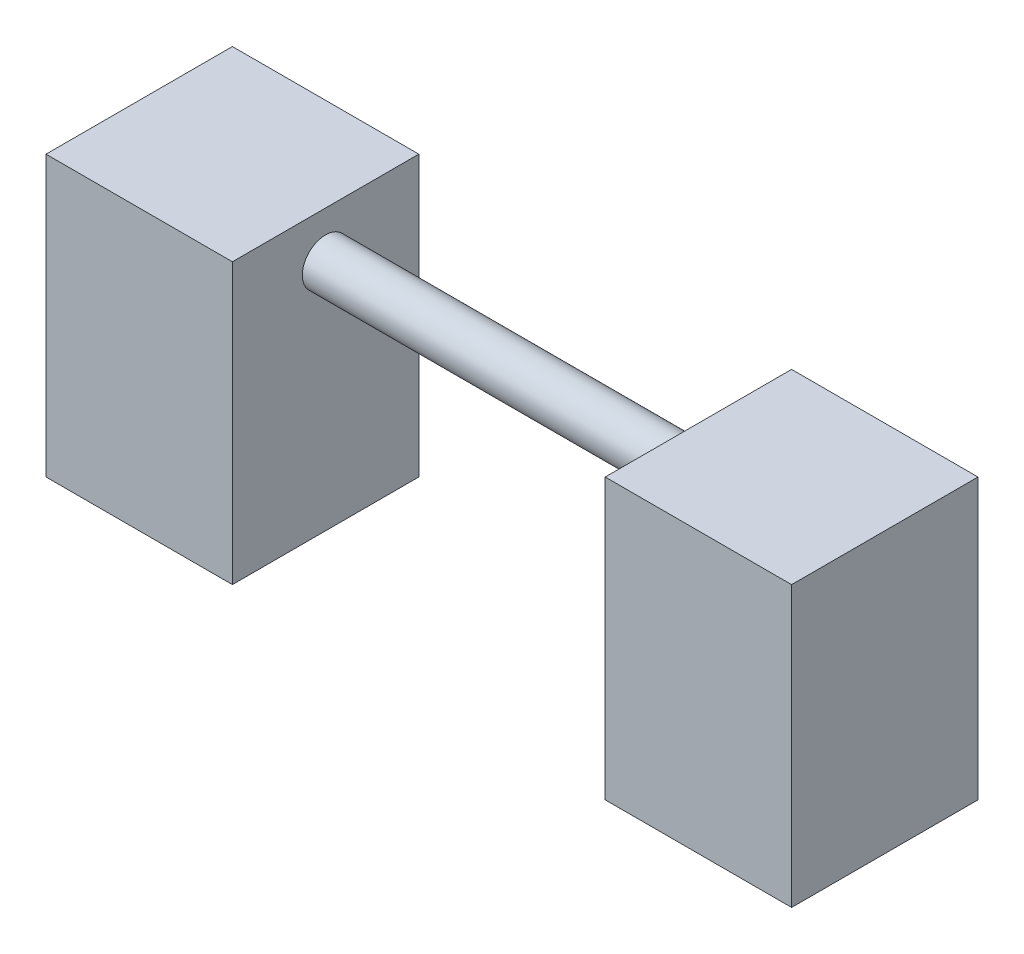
ISO-10303-21;
HEADER;
FILE_DESCRIPTION(('STEP AP214'),'2;1');
FILE_NAME('part.step','',(''),(''),'','','');
FILE_SCHEMA(('AUTOMOTIVE_DESIGN { 1 0 10303 214 1 1 1 1 }'));
ENDSEC;
DATA;
#1=APPLICATION_CONTEXT('core data for automotive mechanical design processes');
#2=APPLICATION_PROTOCOL_DEFINITION('international standard','automotive_design',2000,#1);
#3=PRODUCT_CONTEXT('',#1,'mechanical');
#4=PRODUCT('Part','Part','',(#3));
#5=PRODUCT_RELATED_PRODUCT_CATEGORY('part','',(#4));
#6=PRODUCT_DEFINITION_FORMATION('','',#4);
#7=PRODUCT_DEFINITION_CONTEXT('part definition',#1,'design');
#8=PRODUCT_DEFINITION('design','',#6,#7);
#9=PRODUCT_DEFINITION_SHAPE('','',#8);
#10=(LENGTH_UNIT() NAMED_UNIT(*) SI_UNIT(.MILLI.,.METRE.));
#11=(NAMED_UNIT(*) PLANE_ANGLE_UNIT() SI_UNIT($,.RADIAN.));
#12=(NAMED_UNIT(*) SI_UNIT($,.STERADIAN.) SOLID_ANGLE_UNIT());
#13=UNCERTAINTY_MEASURE_WITH_UNIT(LENGTH_MEASURE(1.E-05),#10,'distance_accuracy_value','');
#14=(GEOMETRIC_REPRESENTATION_CONTEXT(3) GLOBAL_UNCERTAINTY_ASSIGNED_CONTEXT((#13)) GLOBAL_UNIT_ASSIGNED_CONTEXT((#10,
#11,#12)) REPRESENTATION_CONTEXT('',''));
#15=CARTESIAN_POINT('',(0.,0.,0.));
#16=DIRECTION('',(0.,0.,1.));
#17=DIRECTION('',(1.,0.,0.));
#18=AXIS2_PLACEMENT_3D('',#15,#16,#17);
#19=CARTESIAN_POINT('',(-80.,60.,20.));
#20=DIRECTION('',(1.,0.,0.));
#21=DIRECTION('',(0.,0.,-1.));
#22=AXIS2_PLACEMENT_3D('',#19,#20,#21);
#23=PLANE('',#22);
#24=DIRECTION('',(0.,0.,1.));
#25=VECTOR('',#24,1.);
#26=CARTESIAN_POINT('',(-80.,0.,20.));
#27=LINE('',#26,#25);
#28=CARTESIAN_POINT('',(-80.,0.,-20.));
#29=VERTEX_POINT('',#28);
#30=CARTESIAN_POINT('',(-80.,0.,20.));
#31=VERTEX_POINT('',#30);
#32=EDGE_CURVE('E144',#29,#31,#27,.T.);
#33=ORIENTED_EDGE('',*,*,#32,.T.);
#34=DIRECTION('',(0.,-1.,0.));
#35=VECTOR('',#34,1.);
#36=CARTESIAN_POINT('',(-80.,60.,20.));
#37=LINE('',#36,#35);
#38=CARTESIAN_POINT('',(-80.,60.,20.));
#39=VERTEX_POINT('',#38);
#40=EDGE_CURVE('E11',#39,#31,#37,.T.);
#41=ORIENTED_EDGE('',*,*,#40,.F.);
#42=DIRECTION('',(0.,0.,1.));
#43=VECTOR('',#42,1.);
#44=CARTESIAN_POINT('',(-80.,60.,20.));
#45=LINE('',#44,#43);
#46=CARTESIAN_POINT('',(-80.,60.,-20.));
#47=VERTEX_POINT('',#46);
#48=EDGE_CURVE('E145',#47,#39,#45,.T.);
#49=ORIENTED_EDGE('',*,*,#48,.F.);
#50=DIRECTION('',(0.,-1.,0.));
#51=VECTOR('',#50,1.);
#52=CARTESIAN_POINT('',(-80.,60.,-20.));
#53=LINE('',#52,#51);
#54=EDGE_CURVE('E151',#47,#29,#53,.T.);
#55=ORIENTED_EDGE('',*,*,#54,.T.);
#56=EDGE_LOOP('',(#33,#41,#49,#55));
#57=FACE_BOUND('',#56,.T.);
#58=ADVANCED_FACE('F34',(#57),#23,.F.);
#59=CARTESIAN_POINT('',(-40.,60.,20.));
#60=DIRECTION('',(0.,0.,-1.));
#61=DIRECTION('',(-1.,0.,0.));
#62=AXIS2_PLACEMENT_3D('',#59,#60,#61);
#63=PLANE('',#62);
#64=DIRECTION('',(1.,0.,0.));
#65=VECTOR('',#64,1.);
#66=CARTESIAN_POINT('',(-40.,0.,20.));
#67=LINE('',#66,#65);
#68=CARTESIAN_POINT('',(-40.,0.,20.));
#69=VERTEX_POINT('',#68);
#70=EDGE_CURVE('E154',#31,#69,#67,.T.);
#71=ORIENTED_EDGE('',*,*,#70,.T.);
#72=DIRECTION('',(0.,-1.,0.));
#73=VECTOR('',#72,1.);
#74=CARTESIAN_POINT('',(-40.,60.,20.));
#75=LINE('',#74,#73);
#76=CARTESIAN_POINT('',(-40.,60.,20.));
#77=VERTEX_POINT('',#76);
#78=EDGE_CURVE('E42',#77,#69,#75,.T.);
#79=ORIENTED_EDGE('',*,*,#78,.F.);
#80=DIRECTION('',(1.,0.,0.));
#81=VECTOR('',#80,1.);
#82=CARTESIAN_POINT('',(-40.,60.,20.));
#83=LINE('',#82,#81);
#84=EDGE_CURVE('E81',#39,#77,#83,.T.);
#85=ORIENTED_EDGE('',*,*,#84,.F.);
#86=ORIENTED_EDGE('',*,*,#40,.T.);
#87=EDGE_LOOP('',(#71,#79,#85,#86));
#88=FACE_BOUND('',#87,.T.);
#89=ADVANCED_FACE('F177',(#88),#63,.F.);
#90=CARTESIAN_POINT('',(-40.,60.,20.));
#91=DIRECTION('',(-1.,0.,0.));
#92=DIRECTION('',(0.,0.,1.));
#93=AXIS2_PLACEMENT_3D('',#90,#91,#92);
#94=PLANE('',#93);
#95=CARTESIAN_POINT('',(-40.0000000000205,50.,0.));
#96=DIRECTION('',(-1.,0.,0.));
#97=DIRECTION('',(0.,0.,1.));
#98=AXIS2_PLACEMENT_3D('',#95,#96,#97);
#99=CIRCLE('',#98,5.);
#100=CARTESIAN_POINT('',(-39.9999999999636,50.,-5.));
#101=VERTEX_POINT('',#100);
#102=EDGE_CURVE('E136',#101,#101,#99,.F.);
#103=ORIENTED_EDGE('',*,*,#102,.F.);
#104=EDGE_LOOP('',(#103));
#105=FACE_BOUND('',#104,.T.);
#106=DIRECTION('',(0.,0.,-1.));
#107=VECTOR('',#106,1.);
#108=CARTESIAN_POINT('',(-40.,0.,20.));
#109=LINE('',#108,#107);
#110=CARTESIAN_POINT('',(-40.,0.,-20.));
#111=VERTEX_POINT('',#110);
#112=EDGE_CURVE('E68',#69,#111,#109,.T.);
#113=ORIENTED_EDGE('',*,*,#112,.T.);
#114=DIRECTION('',(0.,-1.,0.));
#115=VECTOR('',#114,1.);
#116=CARTESIAN_POINT('',(-40.,60.,-20.));
#117=LINE('',#116,#115);
#118=CARTESIAN_POINT('',(-40.,60.,-20.));
#119=VERTEX_POINT('',#118);
#120=EDGE_CURVE('E159',#119,#111,#117,.T.);
#121=ORIENTED_EDGE('',*,*,#120,.F.);
#122=DIRECTION('',(0.,0.,-1.));
#123=VECTOR('',#122,1.);
#124=CARTESIAN_POINT('',(-40.,60.,20.));
#125=LINE('',#124,#123);
#126=EDGE_CURVE('E148',#77,#119,#125,.T.);
#127=ORIENTED_EDGE('',*,*,#126,.F.);
#128=ORIENTED_EDGE('',*,*,#78,.T.);
#129=EDGE_LOOP('',(#113,#121,#127,#128));
#130=FACE_BOUND('',#129,.T.);
#131=ADVANCED_FACE('F161',(#105,#130),#94,.F.);
#132=CARTESIAN_POINT('',(-40.,60.,-20.));
#133=DIRECTION('',(0.,0.,1.));
#134=DIRECTION('',(1.,0.,0.));
#135=AXIS2_PLACEMENT_3D('',#132,#133,#134);
#136=PLANE('',#135);
#137=DIRECTION('',(-1.,0.,0.));
#138=VECTOR('',#137,1.);
#139=CARTESIAN_POINT('',(-40.,0.,-20.));
#140=LINE('',#139,#138);
#141=EDGE_CURVE('E74',#111,#29,#140,.T.);
#142=ORIENTED_EDGE('',*,*,#141,.T.);
#143=ORIENTED_EDGE('',*,*,#54,.F.);
#144=DIRECTION('',(-1.,0.,0.));
#145=VECTOR('',#144,1.);
#146=CARTESIAN_POINT('',(-40.,60.,-20.));
#147=LINE('',#146,#145);
#148=EDGE_CURVE('E50',#119,#47,#147,.T.);
#149=ORIENTED_EDGE('',*,*,#148,.F.);
#150=ORIENTED_EDGE('',*,*,#120,.T.);
#151=EDGE_LOOP('',(#142,#143,#149,#150));
#152=FACE_BOUND('',#151,.T.);
#153=ADVANCED_FACE('F168',(#152),#136,.F.);
#154=CARTESIAN_POINT('',(0.,60.,0.));
#155=DIRECTION('',(0.,1.,0.));
#156=DIRECTION('',(0.,0.,1.));
#157=AXIS2_PLACEMENT_3D('',#154,#155,#156);
#158=PLANE('',#157);
#159=ORIENTED_EDGE('',*,*,#48,.T.);
#160=ORIENTED_EDGE('',*,*,#84,.T.);
#161=ORIENTED_EDGE('',*,*,#126,.T.);
#162=ORIENTED_EDGE('',*,*,#148,.T.);
#163=EDGE_LOOP('',(#159,#160,#161,#162));
#164=FACE_BOUND('',#163,.T.);
#165=ADVANCED_FACE('F170',(#164),#158,.T.);
#166=CARTESIAN_POINT('',(0.,0.,0.));
#167=DIRECTION('',(0.,1.,0.));
#168=DIRECTION('',(0.,0.,1.));
#169=AXIS2_PLACEMENT_3D('',#166,#167,#168);
#170=PLANE('',#169);
#171=ORIENTED_EDGE('',*,*,#32,.F.);
#172=ORIENTED_EDGE('',*,*,#141,.F.);
#173=ORIENTED_EDGE('',*,*,#112,.F.);
#174=ORIENTED_EDGE('',*,*,#70,.F.);
#175=EDGE_LOOP('',(#171,#172,#173,#174));
#176=FACE_BOUND('',#175,.T.);
#177=ADVANCED_FACE('F164',(#176),#170,.F.);
#178=CARTESIAN_POINT('',(-500000.,50.,0.));
#179=DIRECTION('',(1.,0.,0.));
#180=DIRECTION('',(0.,0.,-1.));
#181=AXIS2_PLACEMENT_3D('',#178,#179,#180);
#182=CYLINDRICAL_SURFACE('',#181,5.);
#183=CARTESIAN_POINT('',(40.0000000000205,50.,0.));
#184=DIRECTION('',(1.,0.,0.));
#185=DIRECTION('',(0.,0.,-1.));
#186=AXIS2_PLACEMENT_3D('',#183,#184,#185);
#187=CIRCLE('',#186,5.);
#188=CARTESIAN_POINT('',(39.9999999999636,50.,-5.));
#189=VERTEX_POINT('',#188);
#190=EDGE_CURVE('E133',#189,#189,#187,.T.);
#191=CARTESIAN_POINT('',(-39.9999999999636,50.,-5.));
#192=CARTESIAN_POINT('',(-39.166666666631,50.,-5.));
#193=CARTESIAN_POINT('',(-38.3333333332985,50.,-5.));
#194=CARTESIAN_POINT('',(-36.6666666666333,50.,-5.));
#195=CARTESIAN_POINT('',(-35.8333333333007,50.,-5.));
#196=CARTESIAN_POINT('',(-34.1666666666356,50.,-5.));
#197=CARTESIAN_POINT('',(-33.333333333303,50.,-5.));
#198=CARTESIAN_POINT('',(-31.6666666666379,50.,-5.));
#199=CARTESIAN_POINT('',(-30.8333333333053,50.,-5.));
#200=CARTESIAN_POINT('',(-29.1666666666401,50.,-5.));
#201=CARTESIAN_POINT('',(-28.3333333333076,50.,-5.));
#202=CARTESIAN_POINT('',(-26.6666666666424,50.,-5.));
#203=CARTESIAN_POINT('',(-25.8333333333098,50.,-5.));
#204=CARTESIAN_POINT('',(-24.1666666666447,50.,-5.));
#205=CARTESIAN_POINT('',(-23.3333333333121,50.,-5.));
#206=CARTESIAN_POINT('',(-21.666666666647,50.,-5.));
#207=CARTESIAN_POINT('',(-20.8333333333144,50.,-5.));
#208=CARTESIAN_POINT('',(-19.1666666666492,50.,-5.));
#209=CARTESIAN_POINT('',(-18.3333333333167,50.,-5.));
#210=CARTESIAN_POINT('',(-16.6666666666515,50.,-5.));
#211=CARTESIAN_POINT('',(-15.8333333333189,50.,-5.));
#212=CARTESIAN_POINT('',(-14.1666666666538,50.,-5.));
#213=CARTESIAN_POINT('',(-13.3333333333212,50.,-5.));
#214=CARTESIAN_POINT('',(-11.6666666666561,50.,-5.));
#215=CARTESIAN_POINT('',(-10.8333333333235,50.,-5.));
#216=CARTESIAN_POINT('',(-9.16666666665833,50.,-5.));
#217=CARTESIAN_POINT('',(-8.33333333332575,50.,-5.));
#218=CARTESIAN_POINT('',(-6.6666666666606,50.,-5.));
#219=CARTESIAN_POINT('',(-5.83333333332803,50.,-5.));
#220=CARTESIAN_POINT('',(-4.16666666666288,50.,-5.));
#221=CARTESIAN_POINT('',(-3.3333333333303,50.,-5.));
#222=CARTESIAN_POINT('',(-1.66666666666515,50.,-5.));
#223=CARTESIAN_POINT('',(-0.833333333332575,50.,-5.));
#224=CARTESIAN_POINT('',(0.833333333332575,50.,-5.));
#225=CARTESIAN_POINT('',(1.66666666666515,50.,-5.));
#226=CARTESIAN_POINT('',(3.3333333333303,50.,-5.));
#227=CARTESIAN_POINT('',(4.16666666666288,50.,-5.));
#228=CARTESIAN_POINT('',(5.83333333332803,50.,-5.));
#229=CARTESIAN_POINT('',(6.6666666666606,50.,-5.));
#230=CARTESIAN_POINT('',(8.33333333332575,50.,-5.));
#231=CARTESIAN_POINT('',(9.16666666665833,50.,-5.));
#232=CARTESIAN_POINT('',(10.8333333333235,50.,-5.));
#233=CARTESIAN_POINT('',(11.6666666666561,50.,-5.));
#234=CARTESIAN_POINT('',(13.3333333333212,50.,-5.));
#235=CARTESIAN_POINT('',(14.1666666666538,50.,-5.));
#236=CARTESIAN_POINT('',(15.8333333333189,50.,-5.));
#237=CARTESIAN_POINT('',(16.6666666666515,50.,-5.));
#238=CARTESIAN_POINT('',(18.3333333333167,50.,-5.));
#239=CARTESIAN_POINT('',(19.1666666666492,50.,-5.));
#240=CARTESIAN_POINT('',(20.8333333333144,50.,-5.));
#241=CARTESIAN_POINT('',(21.666666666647,50.,-5.));
#242=CARTESIAN_POINT('',(23.3333333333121,50.,-5.));
#243=CARTESIAN_POINT('',(24.1666666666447,50.,-5.));
#244=CARTESIAN_POINT('',(25.8333333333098,50.,-5.));
#245=CARTESIAN_POINT('',(26.6666666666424,50.,-5.));
#246=CARTESIAN_POINT('',(28.3333333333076,50.,-5.));
#247=CARTESIAN_POINT('',(29.1666666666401,50.,-5.));
#248=CARTESIAN_POINT('',(30.8333333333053,50.,-5.));
#249=CARTESIAN_POINT('',(31.6666666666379,50.,-5.));
#250=CARTESIAN_POINT('',(33.333333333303,50.,-5.));
#251=CARTESIAN_POINT('',(34.1666666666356,50.,-5.));
#252=CARTESIAN_POINT('',(35.8333333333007,50.,-5.));
#253=CARTESIAN_POINT('',(36.6666666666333,50.,-5.));
#254=CARTESIAN_POINT('',(38.3333333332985,50.,-5.));
#255=CARTESIAN_POINT('',(39.166666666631,50.,-5.));
#256=CARTESIAN_POINT('',(39.9999999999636,50.,-5.));
#257=B_SPLINE_CURVE_WITH_KNOTS('',3,(#191,#192,#193,#194,#195,#196,#197,#198,#199,#200,#201,
#202,#203,#204,#205,#206,#207,#208,#209,#210,#211,#212,#213,#214,#215,#216,#217,#218,#219,#220,
#221,#222,#223,#224,#225,#226,#227,#228,#229,#230,#231,#232,#233,#234,#235,#236,#237,#238,#239,
#240,#241,#242,#243,#244,#245,#246,#247,#248,#249,#250,#251,#252,#253,#254,#255,#256),
.UNSPECIFIED.,.F.,.F.,(4,2,2,2,2,2,2,2,2,2,2,2,2,2,2,2,2,2,2,2,2,2,2,2,2,2,2,2,2,2,2,2,4),(0.,
2.49999999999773,4.99999999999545,7.49999999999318,9.99999999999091,12.4999999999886,
14.9999999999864,17.4999999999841,19.9999999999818,22.4999999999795,24.9999999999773,
27.499999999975,29.9999999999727,32.4999999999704,34.9999999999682,37.4999999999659,
39.9999999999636,42.4999999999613,44.9999999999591,47.4999999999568,49.9999999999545,
52.4999999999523,54.99999999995,57.4999999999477,59.9999999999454,62.4999999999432,
64.9999999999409,67.4999999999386,69.9999999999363,72.4999999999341,74.9999999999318,
77.4999999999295,79.9999999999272),.UNSPECIFIED.);
#258=EDGE_CURVE('BSEAM202',#101,#189,#257,.T.);
#259=ORIENTED_EDGE('',*,*,#102,.T.);
#260=ORIENTED_EDGE('',*,*,#190,.F.);
#261=ORIENTED_EDGE('',*,*,#258,.T.);
#262=ORIENTED_EDGE('',*,*,#258,.F.);
#263=EDGE_LOOP('',(#259,#261,#260,#262));
#264=FACE_BOUND('',#263,.T.);
#265=ADVANCED_FACE('F202',(#264),#182,.T.);
#266=CARTESIAN_POINT('',(40.,60.,20.));
#267=DIRECTION('',(1.,0.,0.));
#268=DIRECTION('',(0.,0.,-1.));
#269=AXIS2_PLACEMENT_3D('',#266,#267,#268);
#270=PLANE('',#269);
#271=ORIENTED_EDGE('',*,*,#190,.T.);
#272=EDGE_LOOP('',(#271));
#273=FACE_BOUND('',#272,.T.);
#274=DIRECTION('',(0.,0.,1.));
#275=VECTOR('',#274,1.);
#276=CARTESIAN_POINT('',(40.,0.,20.));
#277=LINE('',#276,#275);
#278=CARTESIAN_POINT('',(40.,0.,-20.));
#279=VERTEX_POINT('',#278);
#280=CARTESIAN_POINT('',(40.,0.,20.));
#281=VERTEX_POINT('',#280);
#282=EDGE_CURVE('E132',#279,#281,#277,.T.);
#283=ORIENTED_EDGE('',*,*,#282,.T.);
#284=DIRECTION('',(0.,-1.,0.));
#285=VECTOR('',#284,1.);
#286=CARTESIAN_POINT('',(40.,60.,20.));
#287=LINE('',#286,#285);
#288=CARTESIAN_POINT('',(40.,60.,20.));
#289=VERTEX_POINT('',#288);
#290=EDGE_CURVE('E112',#289,#281,#287,.T.);
#291=ORIENTED_EDGE('',*,*,#290,.F.);
#292=DIRECTION('',(0.,0.,1.));
#293=VECTOR('',#292,1.);
#294=CARTESIAN_POINT('',(40.,60.,20.));
#295=LINE('',#294,#293);
#296=CARTESIAN_POINT('',(40.,60.,-20.));
#297=VERTEX_POINT('',#296);
#298=EDGE_CURVE('E119',#297,#289,#295,.T.);
#299=ORIENTED_EDGE('',*,*,#298,.F.);
#300=DIRECTION('',(0.,-1.,0.));
#301=VECTOR('',#300,1.);
#302=CARTESIAN_POINT('',(40.,60.,-20.));
#303=LINE('',#302,#301);
#304=EDGE_CURVE('E288',#297,#279,#303,.T.);
#305=ORIENTED_EDGE('',*,*,#304,.T.);
#306=EDGE_LOOP('',(#283,#291,#299,#305));
#307=FACE_BOUND('',#306,.T.);
#308=ADVANCED_FACE('F130',(#273,#307),#270,.F.);
#309=CARTESIAN_POINT('',(40.,60.,20.));
#310=DIRECTION('',(0.,0.,-1.));
#311=DIRECTION('',(-1.,0.,0.));
#312=AXIS2_PLACEMENT_3D('',#309,#310,#311);
#313=PLANE('',#312);
#314=DIRECTION('',(1.,0.,0.));
#315=VECTOR('',#314,1.);
#316=CARTESIAN_POINT('',(40.,0.,20.));
#317=LINE('',#316,#315);
#318=CARTESIAN_POINT('',(80.,0.,20.));
#319=VERTEX_POINT('',#318);
#320=EDGE_CURVE('E279',#281,#319,#317,.T.);
#321=ORIENTED_EDGE('',*,*,#320,.T.);
#322=DIRECTION('',(0.,-1.,0.));
#323=VECTOR('',#322,1.);
#324=CARTESIAN_POINT('',(80.,60.,20.));
#325=LINE('',#324,#323);
#326=CARTESIAN_POINT('',(80.,60.,20.));
#327=VERTEX_POINT('',#326);
#328=EDGE_CURVE('E115',#327,#319,#325,.T.);
#329=ORIENTED_EDGE('',*,*,#328,.F.);
#330=DIRECTION('',(1.,0.,0.));
#331=VECTOR('',#330,1.);
#332=CARTESIAN_POINT('',(40.,60.,20.));
#333=LINE('',#332,#331);
#334=EDGE_CURVE('E108',#289,#327,#333,.T.);
#335=ORIENTED_EDGE('',*,*,#334,.F.);
#336=ORIENTED_EDGE('',*,*,#290,.T.);
#337=EDGE_LOOP('',(#321,#329,#335,#336));
#338=FACE_BOUND('',#337,.T.);
#339=ADVANCED_FACE('F110',(#338),#313,.F.);
#340=CARTESIAN_POINT('',(80.,60.,20.));
#341=DIRECTION('',(-1.,0.,0.));
#342=DIRECTION('',(0.,0.,1.));
#343=AXIS2_PLACEMENT_3D('',#340,#341,#342);
#344=PLANE('',#343);
#345=DIRECTION('',(0.,0.,-1.));
#346=VECTOR('',#345,1.);
#347=CARTESIAN_POINT('',(80.,0.,20.));
#348=LINE('',#347,#346);
#349=CARTESIAN_POINT('',(80.,0.,-20.));
#350=VERTEX_POINT('',#349);
#351=EDGE_CURVE('E281',#319,#350,#348,.T.);
#352=ORIENTED_EDGE('',*,*,#351,.T.);
#353=DIRECTION('',(0.,-1.,0.));
#354=VECTOR('',#353,1.);
#355=CARTESIAN_POINT('',(80.,60.,-20.));
#356=LINE('',#355,#354);
#357=CARTESIAN_POINT('',(80.,60.,-20.));
#358=VERTEX_POINT('',#357);
#359=EDGE_CURVE('E138',#358,#350,#356,.T.);
#360=ORIENTED_EDGE('',*,*,#359,.F.);
#361=DIRECTION('',(0.,0.,-1.));
#362=VECTOR('',#361,1.);
#363=CARTESIAN_POINT('',(80.,60.,20.));
#364=LINE('',#363,#362);
#365=EDGE_CURVE('E118',#327,#358,#364,.T.);
#366=ORIENTED_EDGE('',*,*,#365,.F.);
#367=ORIENTED_EDGE('',*,*,#328,.T.);
#368=EDGE_LOOP('',(#352,#360,#366,#367));
#369=FACE_BOUND('',#368,.T.);
#370=ADVANCED_FACE('F226',(#369),#344,.F.);
#371=CARTESIAN_POINT('',(40.,60.,-20.));
#372=DIRECTION('',(0.,0.,1.));
#373=DIRECTION('',(1.,0.,0.));
#374=AXIS2_PLACEMENT_3D('',#371,#372,#373);
#375=PLANE('',#374);
#376=DIRECTION('',(-1.,0.,0.));
#377=VECTOR('',#376,1.);
#378=CARTESIAN_POINT('',(40.,0.,-20.));
#379=LINE('',#378,#377);
#380=EDGE_CURVE('E128',#350,#279,#379,.T.);
#381=ORIENTED_EDGE('',*,*,#380,.T.);
#382=ORIENTED_EDGE('',*,*,#304,.F.);
#383=DIRECTION('',(-1.,0.,0.));
#384=VECTOR('',#383,1.);
#385=CARTESIAN_POINT('',(40.,60.,-20.));
#386=LINE('',#385,#384);
#387=EDGE_CURVE('E124',#358,#297,#386,.T.);
#388=ORIENTED_EDGE('',*,*,#387,.F.);
#389=ORIENTED_EDGE('',*,*,#359,.T.);
#390=EDGE_LOOP('',(#381,#382,#388,#389));
#391=FACE_BOUND('',#390,.T.);
#392=ADVANCED_FACE('F235',(#391),#375,.F.);
#393=CARTESIAN_POINT('',(0.,60.,0.));
#394=DIRECTION('',(0.,-1.,0.));
#395=DIRECTION('',(0.,0.,-1.));
#396=AXIS2_PLACEMENT_3D('',#393,#394,#395);
#397=PLANE('',#396);
#398=ORIENTED_EDGE('',*,*,#298,.T.);
#399=ORIENTED_EDGE('',*,*,#334,.T.);
#400=ORIENTED_EDGE('',*,*,#365,.T.);
#401=ORIENTED_EDGE('',*,*,#387,.T.);
#402=EDGE_LOOP('',(#398,#399,#400,#401));
#403=FACE_BOUND('',#402,.T.);
#404=ADVANCED_FACE('F122',(#403),#397,.F.);
#405=CARTESIAN_POINT('',(0.,0.,0.));
#406=DIRECTION('',(0.,-1.,0.));
#407=DIRECTION('',(0.,0.,-1.));
#408=AXIS2_PLACEMENT_3D('',#405,#406,#407);
#409=PLANE('',#408);
#410=ORIENTED_EDGE('',*,*,#282,.F.);
#411=ORIENTED_EDGE('',*,*,#380,.F.);
#412=ORIENTED_EDGE('',*,*,#351,.F.);
#413=ORIENTED_EDGE('',*,*,#320,.F.);
#414=EDGE_LOOP('',(#410,#411,#412,#413));
#415=FACE_BOUND('',#414,.T.);
#416=ADVANCED_FACE('F254',(#415),#409,.T.);
#417=CLOSED_SHELL('',(#58,#89,#131,#153,#165,#177,#265,#308,#339,#370,#392,#404,#416));
#418=MANIFOLD_SOLID_BREP('B2',#417);
#419=ADVANCED_BREP_SHAPE_REPRESENTATION('',(#18,#418),#14);
#420=SHAPE_DEFINITION_REPRESENTATION(#9,#419);
ENDSEC;
END-ISO-10303-21;
